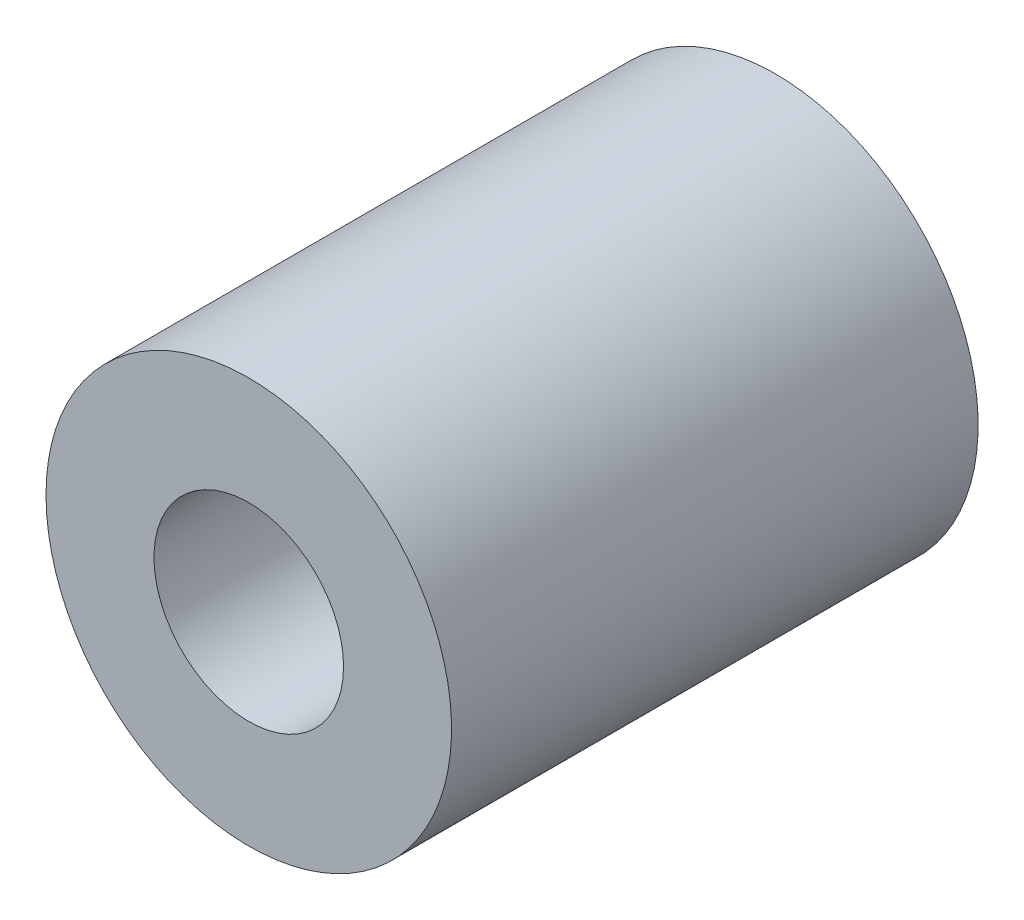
from build123d import *

# Parameters (mm, degrees)
SKETCH1_R           = 9.779
BOSS_EXTRUDE1_DEPTH = 25.4
SKETCH2_R           = 4.5339
CUT_EXTRUDE1_DEPTH  = 9.144
SKETCH3_R           = 4.572
CUT_EXTRUDE2_DEPTH  = 9.144


with BuildPart() as part:
    # Sketch1 → Boss-Extrude1 (new body)
    with BuildSketch(Plane.XY):
        with Locations(Location((0, 0, 0), (0, 0, 180))):
            Circle(SKETCH1_R)
    extrude(amount=BOSS_EXTRUDE1_DEPTH)

    # Sketch2 → Cut-Extrude1 (cut)
    with BuildSketch(Plane(origin=(0, 0, 0), x_dir=(-1, 0, 0), z_dir=(0, 0, -1))):
        Circle(SKETCH2_R)
    extrude(amount=-CUT_EXTRUDE1_DEPTH, mode=Mode.SUBTRACT)

    # Sketch3 → Cut-Extrude2 (cut)
    with BuildSketch(Plane.XY.offset(25.4)):
        Circle(SKETCH3_R)
    extrude(amount=-CUT_EXTRUDE2_DEPTH, mode=Mode.SUBTRACT)


solid = part.part
